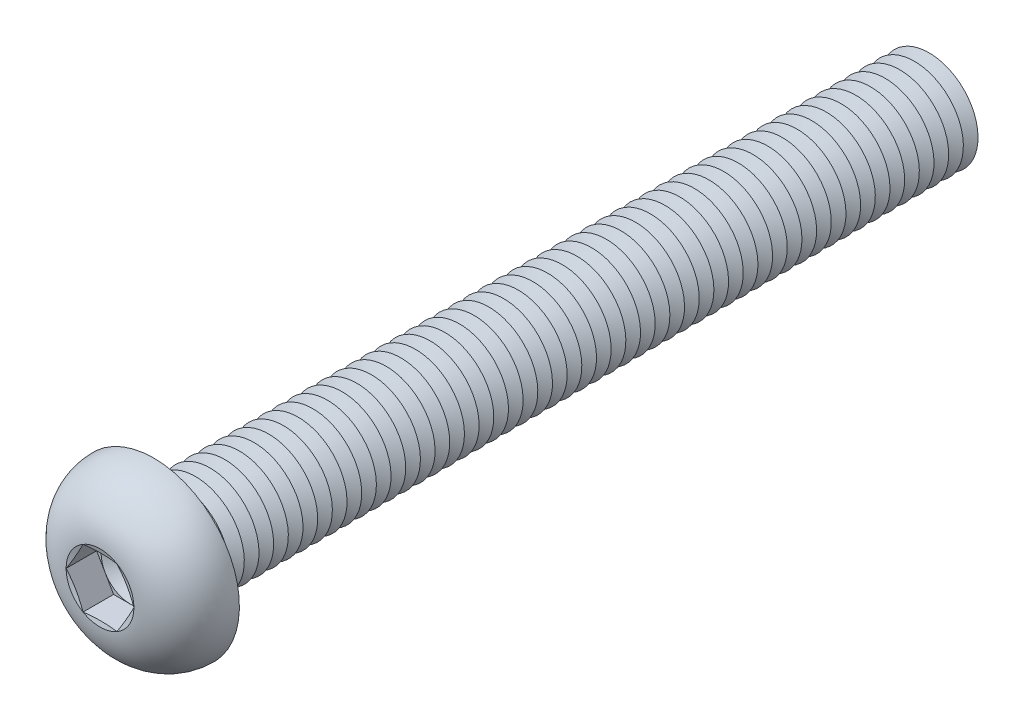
from build123d import *

# Parameters (mm, degrees)
FILLET1_R          = 0.75
LPATTERN1_COUNT    = 53
LPATTERN1_PITCH    = 1.5
CUT_EXTRUDE1_DEPTH = 3.12


with BuildPart() as part:
    # Sketch1 → Revolve1 (revolve)
    with BuildSketch(Plane(origin=(0, 0, 0), x_dir=(0, 0, -1), z_dir=(1, 0, 0))):
        with BuildLine():
            Line((0, 5), (0, 8.75))
            ThreePointArc((0, 8.75), (-3.814142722, 7.21429474), (-5.5, 3.4641))
            Line((-5.5, 3.4641), (-5.035898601, 1.73205))
            Line((-5.035898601, 1.73205), (-5.5, 1.73205))
            Line((-5.5, 1.73205), (-5.5, 0))
            Line((-5.5, 0), (80, 0))
            Line((80, 0), (80, 5))
            Line((80, 5), (0, 5))
        make_face()
    revolve(axis=Axis((0, 0, -80), (0, 0, 1)))

    # Fillet1
    fillet1_edges = [part.edges().sort_by_distance(p)[0] for p in [
        (0, -5, 0),
    ]]
    fillet(fillet1_edges, radius=FILLET1_R)

    # Sketch2 → Cut-Revolve1 (revolve, cut)
    with BuildSketch(Plane(origin=(0, 0, 0), x_dir=(0, 0, -1), z_dir=(1, 0, 0))):
        Polygon((79.25, 5), (80.75, 5), (80, 3.700961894), align=None)
    cut_revolve1 = revolve(axis=Axis((0, 0, -80), (0, 0, -1)), mode=Mode.SUBTRACT)

    # LPattern1: Cut-Revolve1 ×53
    with Locations(*[(0, 0, i * LPATTERN1_PITCH) for i in range(1, LPATTERN1_COUNT)]):
        add(cut_revolve1, mode=Mode.SUBTRACT)

    # Sketch3 → Cut-Extrude1 (cut)
    with BuildSketch(Plane.XY.offset(5.5)):
        Polygon((1.73205, 2.999998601), (-1.73205, 2.999998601), (-3.4641, 0), (-1.73205, -2.999998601), (1.73205, -2.999998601), (3.4641, 0), align=None)
    extrude(amount=-CUT_EXTRUDE1_DEPTH, mode=Mode.SUBTRACT)

    # Cut-Extrude2 cone 1 section (on through the dimple's axis) → Cut-Extrude2 (revolve, cut)
    with BuildSketch(Plane(origin=(0, 0, 2.38), x_dir=(0, -1, 0), z_dir=(1, 0, 0))):
        Polygon((0, 0), (2.999998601, 0), (0, 1.73205), align=None)
    revolve(axis=Axis((0, 0, 2.38), (0, 0, -1)), mode=Mode.SUBTRACT)


solid = part.part
